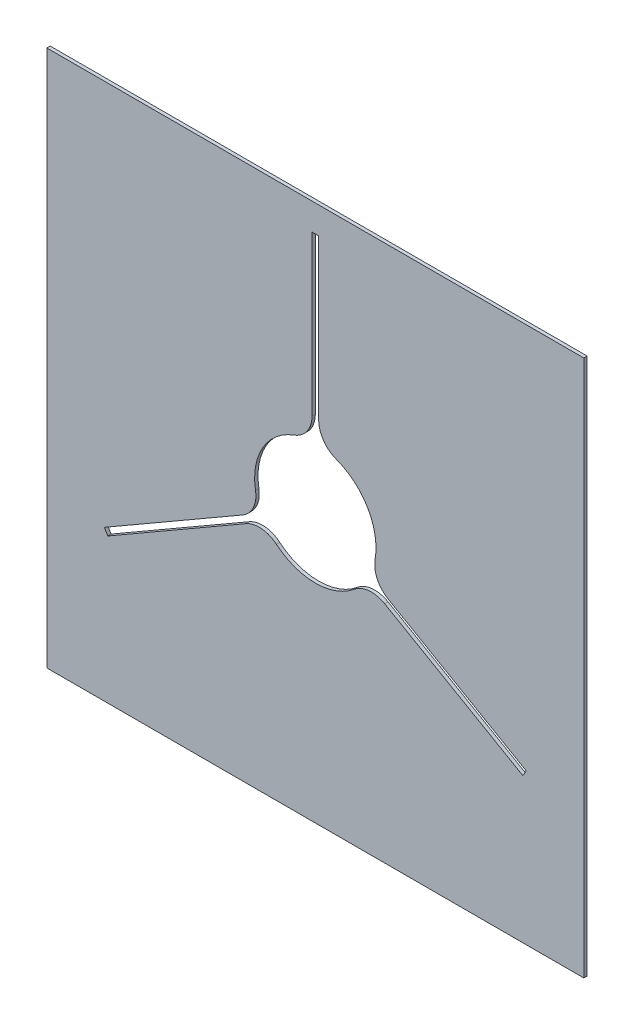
from build123d import *

# Parameters (mm, degrees)
SKETCH1_W                = 254
SKETCH1_H                = 254
BOSS_EXTRUDE1_DEPTH      = 1.5875
SKETCH3_R                = 28.702
CUT_EXTRUDE2_DEPTH       = 180.612138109
SKETCH4_W                = 3.175
SKETCH4_H                = 114.3
CUT_EXTRUDE3_DEPTH       = 180.612138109
FILLET1_R                = 12.7
CIRPATTERN2_COUNT        = 3
FILLET1_OF_CIRPATTERN2_R = 12.7


with BuildPart() as part:
    # Sketch1 → Boss-Extrude1 (new body)
    with BuildSketch(Plane.XY):
        Rectangle(SKETCH1_W, SKETCH1_H)
    extrude(amount=BOSS_EXTRUDE1_DEPTH)

    # Sketch3 → Cut-Extrude2 (cut, through all)
    with BuildSketch(Plane.XY.offset(1.5875)):
        Circle(SKETCH3_R)
    extrude(amount=-CUT_EXTRUDE2_DEPTH, mode=Mode.SUBTRACT)

    # Sketch4 → Cut-Extrude3 (cut, through all)
    with BuildSketch(Plane.XY.offset(1.5875)):
        with Locations((0, 57.15)):
            Rectangle(SKETCH4_W, SKETCH4_H)
    cut_extrude3 = extrude(amount=-CUT_EXTRUDE3_DEPTH, mode=Mode.SUBTRACT)

    # Fillet1
    fillet1_edges = [part.edges().sort_by_distance(p)[0] for p in [
        (-1.5875, 28.658064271, 0.79375),
        (1.5875, 28.658064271, 0.79375),
    ]]
    fillet(fillet1_edges, radius=FILLET1_R)

    # CirPattern2: Cut-Extrude3 ×3 about axis
    cirpattern2_axis = Axis((0, 0, 0), (0, 0, 1))
    for i in range(1, CIRPATTERN2_COUNT):
        add(cut_extrude3.rotate(cirpattern2_axis, i * 360 / CIRPATTERN2_COUNT), mode=Mode.SUBTRACT)

    # Fillet1 of CirPattern2
    fillet1_of_cirpattern2_edges = [part.edges().sort_by_distance(p)[0] for p in [
        (-24.024861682, -15.703847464, 0.79375),
        (-25.612361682, -12.954216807, 0.79375),
        (25.612361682, -12.954216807, 0.79375),
        (24.024861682, -15.703847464, 0.79375),
    ]]
    fillet(fillet1_of_cirpattern2_edges, radius=FILLET1_OF_CIRPATTERN2_R)


solid = part.part
